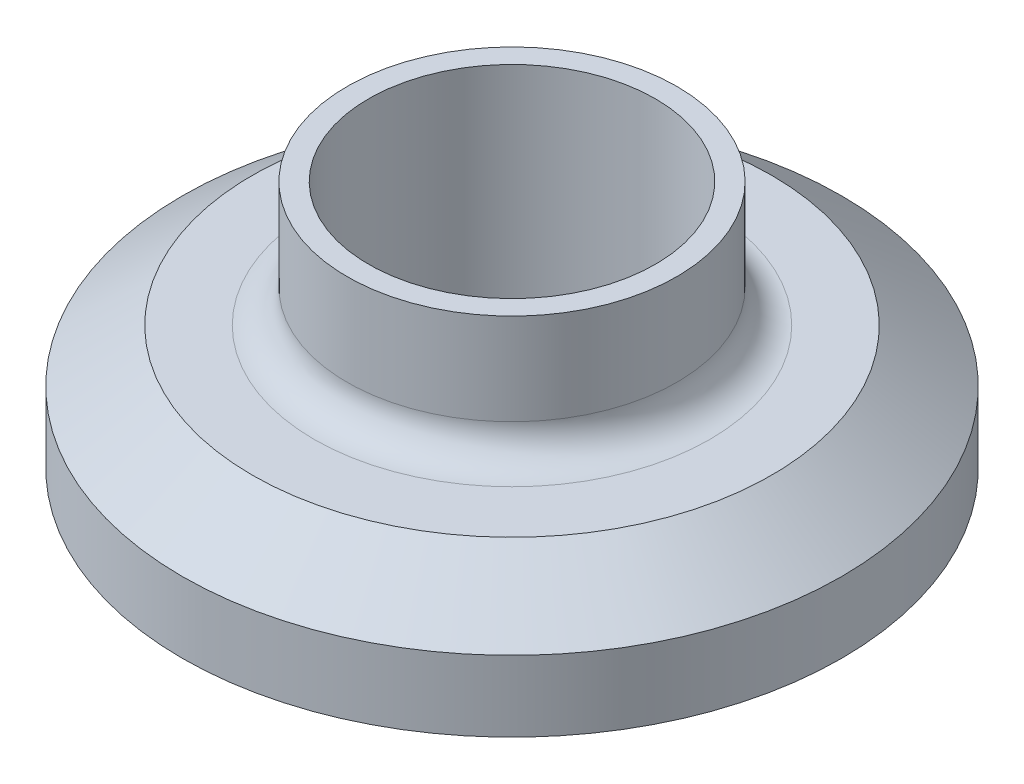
from build123d import *


with BuildPart() as part:
    # Sketch1 → Revolve1 (revolve)
    with BuildSketch(Plane.XY, mode=Mode.PRIVATE) as revolve1_sk:
        with BuildLine():
            Line((-19.612816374, 0), (-25.4, 0))
            Line((-25.4, 0), (-25.4, 5.461))
            Line((-25.4, 5.461), (-20.006889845, 9.525))
            Line((-20.006889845, 9.525), (-15.24, 9.525))
            ThreePointArc((-15.24, 9.525), (-13.443948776, 10.268948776), (-12.7, 12.065))
            Line((-12.7, 12.065), (-12.7, 12.28744703))
            Line((-12.7, 12.28744703), (-12.7, 19.113894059))
            Line((-12.7, 19.113894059), (-11.049, 19.113894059))
            Line((-11.049, 19.113894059), (-11.049, 0))
            Line((-11.049, 0), (-16.556783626, 0))
            ThreePointArc((-16.556783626, 0), (-18.0848, 1.1938), (-19.612816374, 0))
        make_face()
    revolve(revolve1_sk.sketch.rotate(Axis((0, 0, 0), (0, 1, 0)), 270), axis=Axis((0, 0, 0), (0, 1, 0)))


solid = part.part
